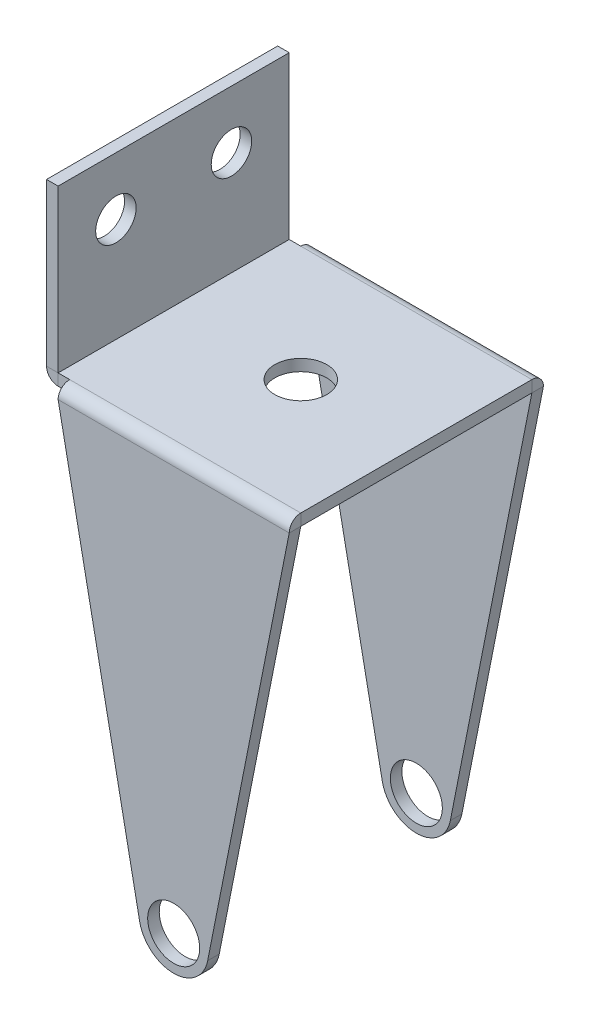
ISO-10303-21;
HEADER;
FILE_DESCRIPTION(('STEP AP214'),'2;1');
FILE_NAME('part.step','',(''),(''),'','','');
FILE_SCHEMA(('AUTOMOTIVE_DESIGN { 1 0 10303 214 1 1 1 1 }'));
ENDSEC;
DATA;
#1=APPLICATION_CONTEXT('core data for automotive mechanical design processes');
#2=APPLICATION_PROTOCOL_DEFINITION('international standard','automotive_design',2000,#1);
#3=PRODUCT_CONTEXT('',#1,'mechanical');
#4=PRODUCT('Part','Part','',(#3));
#5=PRODUCT_RELATED_PRODUCT_CATEGORY('part','',(#4));
#6=PRODUCT_DEFINITION_FORMATION('','',#4);
#7=PRODUCT_DEFINITION_CONTEXT('part definition',#1,'design');
#8=PRODUCT_DEFINITION('design','',#6,#7);
#9=PRODUCT_DEFINITION_SHAPE('','',#8);
#10=(LENGTH_UNIT() NAMED_UNIT(*) SI_UNIT(.MILLI.,.METRE.));
#11=(NAMED_UNIT(*) PLANE_ANGLE_UNIT() SI_UNIT($,.RADIAN.));
#12=(NAMED_UNIT(*) SI_UNIT($,.STERADIAN.) SOLID_ANGLE_UNIT());
#13=UNCERTAINTY_MEASURE_WITH_UNIT(LENGTH_MEASURE(1.E-05),#10,'distance_accuracy_value','');
#14=(GEOMETRIC_REPRESENTATION_CONTEXT(3) GLOBAL_UNCERTAINTY_ASSIGNED_CONTEXT((#13)) GLOBAL_UNIT_ASSIGNED_CONTEXT((#10,
#11,#12)) REPRESENTATION_CONTEXT('',''));
#15=CARTESIAN_POINT('',(0.,0.,0.));
#16=DIRECTION('',(0.,0.,1.));
#17=DIRECTION('',(1.,0.,0.));
#18=AXIS2_PLACEMENT_3D('',#15,#16,#17);
#19=CARTESIAN_POINT('',(0.,0.,45.));
#20=DIRECTION('',(0.,-1.,0.));
#21=DIRECTION('',(0.,0.,-1.));
#22=AXIS2_PLACEMENT_3D('',#19,#20,#21);
#23=PLANE('',#22);
#24=CARTESIAN_POINT('',(0.,0.,0.));
#25=DIRECTION('',(0.,1.,0.));
#26=DIRECTION('',(0.,0.,1.));
#27=AXIS2_PLACEMENT_3D('',#24,#25,#26);
#28=CIRCLE('',#27,2.25);
#29=CARTESIAN_POINT('',(0.,0.,2.25));
#30=VERTEX_POINT('',#29);
#31=EDGE_CURVE('E461',#30,#30,#28,.T.);
#32=ORIENTED_EDGE('',*,*,#31,.T.);
#33=EDGE_LOOP('',(#32));
#34=FACE_BOUND('',#33,.T.);
#35=DIRECTION('',(-1.,0.,0.));
#36=VECTOR('',#35,1.);
#37=CARTESIAN_POINT('',(-10.,0.,-10.));
#38=LINE('',#37,#36);
#39=CARTESIAN_POINT('',(-9.99996573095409,-9.99999999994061E-05,-10.0001));
#40=VERTEX_POINT('',#39);
#41=CARTESIAN_POINT('',(-11.0000000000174,0.,-10.));
#42=VERTEX_POINT('',#41);
#43=EDGE_CURVE('E460',#40,#42,#38,.T.);
#44=ORIENTED_EDGE('',*,*,#43,.F.);
#45=DIRECTION('',(1.,0.,0.));
#46=VECTOR('',#45,1.);
#47=CARTESIAN_POINT('',(0.,0.,-10.0001));
#48=LINE('',#47,#46);
#49=CARTESIAN_POINT('',(9.99996573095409,-9.99999999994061E-05,-10.0001));
#50=VERTEX_POINT('',#49);
#51=EDGE_CURVE('E79',#40,#50,#48,.T.);
#52=ORIENTED_EDGE('',*,*,#51,.T.);
#53=DIRECTION('',(0.,0.,-1.));
#54=VECTOR('',#53,1.);
#55=CARTESIAN_POINT('',(10.,0.,-10.));
#56=LINE('',#55,#54);
#57=CARTESIAN_POINT('',(9.99996573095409,-0.000100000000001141,10.0001));
#58=VERTEX_POINT('',#57);
#59=EDGE_CURVE('E477',#58,#50,#56,.T.);
#60=ORIENTED_EDGE('',*,*,#59,.F.);
#61=DIRECTION('',(-1.,0.,0.));
#62=VECTOR('',#61,1.);
#63=CARTESIAN_POINT('',(0.,0.,10.0001));
#64=LINE('',#63,#62);
#65=CARTESIAN_POINT('',(-9.99996573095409,-0.000100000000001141,10.0001));
#66=VERTEX_POINT('',#65);
#67=EDGE_CURVE('E670',#58,#66,#64,.T.);
#68=ORIENTED_EDGE('',*,*,#67,.T.);
#69=DIRECTION('',(1.,0.,0.));
#70=VECTOR('',#69,1.);
#71=CARTESIAN_POINT('',(-25.,0.,10.));
#72=LINE('',#71,#70);
#73=CARTESIAN_POINT('',(-11.,0.,10.));
#74=VERTEX_POINT('',#73);
#75=EDGE_CURVE('E464',#74,#66,#72,.T.);
#76=ORIENTED_EDGE('',*,*,#75,.F.);
#77=DIRECTION('',(0.,0.,1.));
#78=VECTOR('',#77,1.);
#79=CARTESIAN_POINT('',(-11.,0.,45.));
#80=LINE('',#79,#78);
#81=EDGE_CURVE('E449',#42,#74,#80,.T.);
#82=ORIENTED_EDGE('',*,*,#81,.F.);
#83=EDGE_LOOP('',(#44,#52,#60,#68,#76,#82));
#84=FACE_BOUND('',#83,.T.);
#85=ADVANCED_FACE('F71',(#34,#84),#23,.T.);
#86=CARTESIAN_POINT('',(-12.0001,-10.0000727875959,45.));
#87=DIRECTION('',(-1.,0.,0.));
#88=DIRECTION('',(0.,0.,-1.));
#89=AXIS2_PLACEMENT_3D('',#86,#87,#88);
#90=PLANE('',#89);
#91=CARTESIAN_POINT('',(-12.0001,9.99992721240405,-5.));
#92=DIRECTION('',(1.,0.,0.));
#93=DIRECTION('',(0.,0.,1.));
#94=AXIS2_PLACEMENT_3D('',#91,#92,#93);
#95=CIRCLE('',#94,1.75);
#96=CARTESIAN_POINT('',(-12.0001,9.99992721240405,-3.25));
#97=VERTEX_POINT('',#96);
#98=EDGE_CURVE('E482',#97,#97,#95,.T.);
#99=ORIENTED_EDGE('',*,*,#98,.T.);
#100=EDGE_LOOP('',(#99));
#101=FACE_BOUND('',#100,.T.);
#102=CARTESIAN_POINT('',(-12.0001,9.99992721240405,5.));
#103=DIRECTION('',(1.,0.,0.));
#104=DIRECTION('',(0.,0.,1.));
#105=AXIS2_PLACEMENT_3D('',#102,#103,#104);
#106=CIRCLE('',#105,1.75);
#107=CARTESIAN_POINT('',(-12.0001,9.99992721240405,6.75));
#108=VERTEX_POINT('',#107);
#109=EDGE_CURVE('E459',#108,#108,#106,.T.);
#110=ORIENTED_EDGE('',*,*,#109,.T.);
#111=EDGE_LOOP('',(#110));
#112=FACE_BOUND('',#111,.T.);
#113=DIRECTION('',(0.,1.,0.));
#114=VECTOR('',#113,1.);
#115=CARTESIAN_POINT('',(-12.0001,-7.27875959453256E-05,-10.));
#116=LINE('',#115,#114);
#117=CARTESIAN_POINT('',(-12.0001,1.0001,-10.));
#118=VERTEX_POINT('',#117);
#119=CARTESIAN_POINT('',(-12.0001,14.9999272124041,-10.));
#120=VERTEX_POINT('',#119);
#121=EDGE_CURVE('E86',#118,#120,#116,.T.);
#122=ORIENTED_EDGE('',*,*,#121,.F.);
#123=DIRECTION('',(0.,0.,1.));
#124=VECTOR('',#123,1.);
#125=CARTESIAN_POINT('',(-12.0001,1.0001,45.));
#126=LINE('',#125,#124);
#127=CARTESIAN_POINT('',(-12.0001,1.0001,10.));
#128=VERTEX_POINT('',#127);
#129=EDGE_CURVE('E507',#118,#128,#126,.T.);
#130=ORIENTED_EDGE('',*,*,#129,.T.);
#131=DIRECTION('',(0.,-1.,0.));
#132=VECTOR('',#131,1.);
#133=CARTESIAN_POINT('',(-12.0001,14.9999272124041,10.));
#134=LINE('',#133,#132);
#135=CARTESIAN_POINT('',(-12.0001,14.9999272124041,10.));
#136=VERTEX_POINT('',#135);
#137=EDGE_CURVE('E94',#136,#128,#134,.T.);
#138=ORIENTED_EDGE('',*,*,#137,.F.);
#139=DIRECTION('',(0.,0.,1.));
#140=VECTOR('',#139,1.);
#141=CARTESIAN_POINT('',(-12.0001,14.9999272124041,-10.));
#142=LINE('',#141,#140);
#143=EDGE_CURVE('E494',#120,#136,#142,.T.);
#144=ORIENTED_EDGE('',*,*,#143,.F.);
#145=EDGE_LOOP('',(#122,#130,#138,#144));
#146=FACE_BOUND('',#145,.T.);
#147=ADVANCED_FACE('F595',(#101,#112,#146),#90,.T.);
#148=CARTESIAN_POINT('',(-11.0001,-10.0000727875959,45.));
#149=DIRECTION('',(-1.,0.,0.));
#150=DIRECTION('',(0.,0.,-1.));
#151=AXIS2_PLACEMENT_3D('',#148,#149,#150);
#152=PLANE('',#151);
#153=DIRECTION('',(0.,0.,1.));
#154=VECTOR('',#153,1.);
#155=CARTESIAN_POINT('',(-11.0001,1.0001,45.));
#156=LINE('',#155,#154);
#157=CARTESIAN_POINT('',(-11.0001,1.0001,-10.));
#158=VERTEX_POINT('',#157);
#159=CARTESIAN_POINT('',(-11.0001,1.0001,10.));
#160=VERTEX_POINT('',#159);
#161=EDGE_CURVE('E501',#158,#160,#156,.T.);
#162=ORIENTED_EDGE('',*,*,#161,.F.);
#163=DIRECTION('',(0.,1.,0.));
#164=VECTOR('',#163,1.);
#165=CARTESIAN_POINT('',(-11.0001,-7.2787595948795E-05,-10.));
#166=LINE('',#165,#164);
#167=CARTESIAN_POINT('',(-11.0001,14.999927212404,-10.));
#168=VERTEX_POINT('',#167);
#169=EDGE_CURVE('E493',#158,#168,#166,.T.);
#170=ORIENTED_EDGE('',*,*,#169,.T.);
#171=DIRECTION('',(0.,0.,1.));
#172=VECTOR('',#171,1.);
#173=CARTESIAN_POINT('',(-11.0001,14.999927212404,-10.));
#174=LINE('',#173,#172);
#175=CARTESIAN_POINT('',(-11.0001,14.9999272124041,10.));
#176=VERTEX_POINT('',#175);
#177=EDGE_CURVE('E490',#168,#176,#174,.T.);
#178=ORIENTED_EDGE('',*,*,#177,.T.);
#179=DIRECTION('',(0.,-1.,0.));
#180=VECTOR('',#179,1.);
#181=CARTESIAN_POINT('',(-11.0001,14.9999272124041,10.));
#182=LINE('',#181,#180);
#183=EDGE_CURVE('E492',#176,#160,#182,.T.);
#184=ORIENTED_EDGE('',*,*,#183,.T.);
#185=EDGE_LOOP('',(#162,#170,#178,#184));
#186=FACE_BOUND('',#185,.T.);
#187=CARTESIAN_POINT('',(-11.0001,9.99992721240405,-5.));
#188=DIRECTION('',(1.,0.,0.));
#189=DIRECTION('',(0.,0.,1.));
#190=AXIS2_PLACEMENT_3D('',#187,#188,#189);
#191=CIRCLE('',#190,1.75);
#192=CARTESIAN_POINT('',(-11.0001,9.99992721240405,-3.25));
#193=VERTEX_POINT('',#192);
#194=EDGE_CURVE('E485',#193,#193,#191,.T.);
#195=ORIENTED_EDGE('',*,*,#194,.F.);
#196=EDGE_LOOP('',(#195));
#197=FACE_BOUND('',#196,.T.);
#198=CARTESIAN_POINT('',(-11.0001,9.99992721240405,5.));
#199=DIRECTION('',(1.,0.,0.));
#200=DIRECTION('',(0.,0.,1.));
#201=AXIS2_PLACEMENT_3D('',#198,#199,#200);
#202=CIRCLE('',#201,1.75);
#203=CARTESIAN_POINT('',(-11.0001,9.99992721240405,6.75));
#204=VERTEX_POINT('',#203);
#205=EDGE_CURVE('E479',#204,#204,#202,.T.);
#206=ORIENTED_EDGE('',*,*,#205,.F.);
#207=EDGE_LOOP('',(#206));
#208=FACE_BOUND('',#207,.T.);
#209=ADVANCED_FACE('F600',(#186,#197,#208),#152,.F.);
#210=CARTESIAN_POINT('',(-11.0001,-7.2787595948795E-05,-10.));
#211=DIRECTION('',(0.,0.,1.));
#212=DIRECTION('',(0.,-1.,0.));
#213=AXIS2_PLACEMENT_3D('',#210,#211,#212);
#214=PLANE('',#213);
#215=DIRECTION('',(1.,0.,0.));
#216=VECTOR('',#215,1.);
#217=CARTESIAN_POINT('',(-11.0001,1.0001,-10.));
#218=LINE('',#217,#216);
#219=EDGE_CURVE('E509',#118,#158,#218,.T.);
#220=ORIENTED_EDGE('',*,*,#219,.F.);
#221=ORIENTED_EDGE('',*,*,#121,.T.);
#222=DIRECTION('',(-1.,0.,0.));
#223=VECTOR('',#222,1.);
#224=CARTESIAN_POINT('',(-11.0001,14.999927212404,-10.));
#225=LINE('',#224,#223);
#226=EDGE_CURVE('E498',#168,#120,#225,.T.);
#227=ORIENTED_EDGE('',*,*,#226,.F.);
#228=ORIENTED_EDGE('',*,*,#169,.F.);
#229=EDGE_LOOP('',(#220,#221,#227,#228));
#230=FACE_BOUND('',#229,.T.);
#231=ADVANCED_FACE('F646',(#230),#214,.F.);
#232=CARTESIAN_POINT('',(-11.0001,14.999927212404,-10.));
#233=DIRECTION('',(0.,-1.,0.));
#234=DIRECTION('',(0.,0.,-1.));
#235=AXIS2_PLACEMENT_3D('',#232,#233,#234);
#236=PLANE('',#235);
#237=ORIENTED_EDGE('',*,*,#143,.T.);
#238=DIRECTION('',(-1.,0.,0.));
#239=VECTOR('',#238,1.);
#240=CARTESIAN_POINT('',(-11.0001,14.9999272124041,10.));
#241=LINE('',#240,#239);
#242=EDGE_CURVE('E496',#176,#136,#241,.T.);
#243=ORIENTED_EDGE('',*,*,#242,.F.);
#244=ORIENTED_EDGE('',*,*,#177,.F.);
#245=ORIENTED_EDGE('',*,*,#226,.T.);
#246=EDGE_LOOP('',(#237,#243,#244,#245));
#247=FACE_BOUND('',#246,.T.);
#248=ADVANCED_FACE('F643',(#247),#236,.F.);
#249=CARTESIAN_POINT('',(-11.0001,14.9999272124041,10.));
#250=DIRECTION('',(0.,0.,-1.));
#251=DIRECTION('',(0.,1.,0.));
#252=AXIS2_PLACEMENT_3D('',#249,#250,#251);
#253=PLANE('',#252);
#254=DIRECTION('',(-1.,0.,0.));
#255=VECTOR('',#254,1.);
#256=CARTESIAN_POINT('',(-11.0001,1.0001,10.));
#257=LINE('',#256,#255);
#258=EDGE_CURVE('E504',#160,#128,#257,.T.);
#259=ORIENTED_EDGE('',*,*,#258,.F.);
#260=ORIENTED_EDGE('',*,*,#183,.F.);
#261=ORIENTED_EDGE('',*,*,#242,.T.);
#262=ORIENTED_EDGE('',*,*,#137,.T.);
#263=EDGE_LOOP('',(#259,#260,#261,#262));
#264=FACE_BOUND('',#263,.T.);
#265=ADVANCED_FACE('F641',(#264),#253,.F.);
#266=CARTESIAN_POINT('',(-11.0001,9.99992721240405,-5.));
#267=DIRECTION('',(-1.,0.,0.));
#268=DIRECTION('',(0.,0.,-1.));
#269=AXIS2_PLACEMENT_3D('',#266,#267,#268);
#270=CYLINDRICAL_SURFACE('',#269,1.75);
#271=ORIENTED_EDGE('',*,*,#194,.T.);
#272=EDGE_LOOP('',(#271));
#273=FACE_BOUND('',#272,.T.);
#274=ORIENTED_EDGE('',*,*,#98,.F.);
#275=EDGE_LOOP('',(#274));
#276=FACE_BOUND('',#275,.T.);
#277=ADVANCED_FACE('F637',(#273,#276),#270,.F.);
#278=CARTESIAN_POINT('',(-11.0001,9.99992721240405,5.));
#279=DIRECTION('',(-1.,0.,0.));
#280=DIRECTION('',(0.,0.,-1.));
#281=AXIS2_PLACEMENT_3D('',#278,#279,#280);
#282=CYLINDRICAL_SURFACE('',#281,1.75);
#283=ORIENTED_EDGE('',*,*,#205,.T.);
#284=EDGE_LOOP('',(#283));
#285=FACE_BOUND('',#284,.T.);
#286=ORIENTED_EDGE('',*,*,#109,.F.);
#287=EDGE_LOOP('',(#286));
#288=FACE_BOUND('',#287,.T.);
#289=ADVANCED_FACE('F545',(#285,#288),#282,.F.);
#290=CARTESIAN_POINT('',(10.,1.,-10.));
#291=DIRECTION('',(-1.,0.,0.));
#292=DIRECTION('',(0.,0.,1.));
#293=AXIS2_PLACEMENT_3D('',#290,#291,#292);
#294=PLANE('',#293);
#295=ORIENTED_EDGE('',*,*,#59,.T.);
#296=CARTESIAN_POINT('',(9.99999999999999,1.,-10.));
#297=CARTESIAN_POINT('',(9.99999999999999,0.,-9.99999999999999));
#298=B_SPLINE_CURVE_WITH_KNOTS('',1,(#296,#297),.UNSPECIFIED.,.F.,.F.,(2,2),(0.,1.),.UNSPECIFIED.);
#299=CARTESIAN_POINT('',(9.99999999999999,1.,-10.));
#300=VERTEX_POINT('',#299);
#301=EDGE_CURVE('E305',#300,#50,#298,.T.);
#302=ORIENTED_EDGE('',*,*,#301,.F.);
#303=DIRECTION('',(0.,0.,-1.));
#304=VECTOR('',#303,1.);
#305=CARTESIAN_POINT('',(10.,1.,-10.));
#306=LINE('',#305,#304);
#307=CARTESIAN_POINT('',(10.,1.,10.));
#308=VERTEX_POINT('',#307);
#309=EDGE_CURVE('E468',#308,#300,#306,.T.);
#310=ORIENTED_EDGE('',*,*,#309,.F.);
#311=CARTESIAN_POINT('',(10.,0.,10.));
#312=CARTESIAN_POINT('',(10.,1.,10.));
#313=B_SPLINE_CURVE_WITH_KNOTS('',1,(#311,#312),.UNSPECIFIED.,.F.,.F.,(2,2),(0.,1.),.UNSPECIFIED.);
#314=EDGE_CURVE('E528',#308,#58,#313,.F.);
#315=ORIENTED_EDGE('',*,*,#314,.T.);
#316=EDGE_LOOP('',(#295,#302,#310,#315));
#317=FACE_BOUND('',#316,.T.);
#318=ADVANCED_FACE('F534',(#317),#294,.F.);
#319=CARTESIAN_POINT('',(0.,1.,0.));
#320=DIRECTION('',(0.,-1.,0.));
#321=DIRECTION('',(0.,0.,-1.));
#322=AXIS2_PLACEMENT_3D('',#319,#320,#321);
#323=CYLINDRICAL_SURFACE('',#322,2.25);
#324=CARTESIAN_POINT('',(0.,1.,0.));
#325=DIRECTION('',(0.,1.,0.));
#326=DIRECTION('',(0.,0.,1.));
#327=AXIS2_PLACEMENT_3D('',#324,#325,#326);
#328=CIRCLE('',#327,2.25);
#329=CARTESIAN_POINT('',(0.,1.,2.25));
#330=VERTEX_POINT('',#329);
#331=EDGE_CURVE('E474',#330,#330,#328,.T.);
#332=ORIENTED_EDGE('',*,*,#331,.T.);
#333=EDGE_LOOP('',(#332));
#334=FACE_BOUND('',#333,.T.);
#335=ORIENTED_EDGE('',*,*,#31,.F.);
#336=EDGE_LOOP('',(#335));
#337=FACE_BOUND('',#336,.T.);
#338=ADVANCED_FACE('F544',(#334,#337),#323,.F.);
#339=CARTESIAN_POINT('',(0.,1.,45.));
#340=DIRECTION('',(0.,-1.,0.));
#341=DIRECTION('',(0.,0.,-1.));
#342=AXIS2_PLACEMENT_3D('',#339,#340,#341);
#343=PLANE('',#342);
#344=DIRECTION('',(1.,0.,0.));
#345=VECTOR('',#344,1.);
#346=CARTESIAN_POINT('',(0.,1.,-9.99999999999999));
#347=LINE('',#346,#345);
#348=CARTESIAN_POINT('',(-10.,1.,-10.));
#349=VERTEX_POINT('',#348);
#350=EDGE_CURVE('E623',#349,#300,#347,.T.);
#351=ORIENTED_EDGE('',*,*,#350,.F.);
#352=DIRECTION('',(-1.,0.,0.));
#353=VECTOR('',#352,1.);
#354=CARTESIAN_POINT('',(-10.,1.,-10.));
#355=LINE('',#354,#353);
#356=CARTESIAN_POINT('',(-11.,1.,-10.));
#357=VERTEX_POINT('',#356);
#358=EDGE_CURVE('E473',#349,#357,#355,.T.);
#359=ORIENTED_EDGE('',*,*,#358,.T.);
#360=DIRECTION('',(0.,0.,1.));
#361=VECTOR('',#360,1.);
#362=CARTESIAN_POINT('',(-11.,1.,45.));
#363=LINE('',#362,#361);
#364=CARTESIAN_POINT('',(-11.,1.,10.));
#365=VERTEX_POINT('',#364);
#366=EDGE_CURVE('E469',#357,#365,#363,.T.);
#367=ORIENTED_EDGE('',*,*,#366,.T.);
#368=DIRECTION('',(1.,0.,0.));
#369=VECTOR('',#368,1.);
#370=CARTESIAN_POINT('',(-25.,1.,10.));
#371=LINE('',#370,#369);
#372=CARTESIAN_POINT('',(-10.,1.,9.99999999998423));
#373=VERTEX_POINT('',#372);
#374=EDGE_CURVE('E472',#365,#373,#371,.T.);
#375=ORIENTED_EDGE('',*,*,#374,.T.);
#376=DIRECTION('',(-1.,0.,0.));
#377=VECTOR('',#376,1.);
#378=CARTESIAN_POINT('',(0.,1.,10.));
#379=LINE('',#378,#377);
#380=EDGE_CURVE('E512',#308,#373,#379,.T.);
#381=ORIENTED_EDGE('',*,*,#380,.F.);
#382=ORIENTED_EDGE('',*,*,#309,.T.);
#383=EDGE_LOOP('',(#351,#359,#367,#375,#381,#382));
#384=FACE_BOUND('',#383,.T.);
#385=ORIENTED_EDGE('',*,*,#331,.F.);
#386=EDGE_LOOP('',(#385));
#387=FACE_BOUND('',#386,.T.);
#388=ADVANCED_FACE('F655',(#384,#387),#343,.F.);
#389=CARTESIAN_POINT('',(-25.,1.,10.));
#390=DIRECTION('',(0.,0.,-1.));
#391=DIRECTION('',(-1.,0.,0.));
#392=AXIS2_PLACEMENT_3D('',#389,#390,#391);
#393=PLANE('',#392);
#394=ORIENTED_EDGE('',*,*,#374,.F.);
#395=DIRECTION('',(0.,-1.,0.));
#396=VECTOR('',#395,1.);
#397=CARTESIAN_POINT('',(-11.,1.,10.));
#398=LINE('',#397,#396);
#399=EDGE_CURVE('E465',#365,#74,#398,.T.);
#400=ORIENTED_EDGE('',*,*,#399,.T.);
#401=ORIENTED_EDGE('',*,*,#75,.T.);
#402=CARTESIAN_POINT('',(-10.,1.,9.99999999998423));
#403=CARTESIAN_POINT('',(-10.,0.,10.));
#404=B_SPLINE_CURVE_WITH_KNOTS('',1,(#402,#403),.UNSPECIFIED.,.F.,.F.,(2,2),(0.,1.),.UNSPECIFIED.);
#405=EDGE_CURVE('E432',#373,#66,#404,.T.);
#406=ORIENTED_EDGE('',*,*,#405,.F.);
#407=EDGE_LOOP('',(#394,#400,#401,#406));
#408=FACE_BOUND('',#407,.T.);
#409=ADVANCED_FACE('F633',(#408),#393,.F.);
#410=CARTESIAN_POINT('',(-10.,1.,-10.));
#411=DIRECTION('',(0.,0.,1.));
#412=DIRECTION('',(1.,0.,0.));
#413=AXIS2_PLACEMENT_3D('',#410,#411,#412);
#414=PLANE('',#413);
#415=ORIENTED_EDGE('',*,*,#43,.T.);
#416=DIRECTION('',(0.,1.,0.));
#417=VECTOR('',#416,1.);
#418=CARTESIAN_POINT('',(-11.,1.,-10.));
#419=LINE('',#418,#417);
#420=EDGE_CURVE('E456',#42,#357,#419,.T.);
#421=ORIENTED_EDGE('',*,*,#420,.T.);
#422=ORIENTED_EDGE('',*,*,#358,.F.);
#423=CARTESIAN_POINT('',(-10.,0.,-9.99999999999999));
#424=CARTESIAN_POINT('',(-10.,1.,-10.));
#425=B_SPLINE_CURVE_WITH_KNOTS('',1,(#423,#424),.UNSPECIFIED.,.F.,.F.,(2,2),(0.,1.),.UNSPECIFIED.);
#426=EDGE_CURVE('E12',#349,#40,#425,.F.);
#427=ORIENTED_EDGE('',*,*,#426,.T.);
#428=EDGE_LOOP('',(#415,#421,#422,#427));
#429=FACE_BOUND('',#428,.T.);
#430=ADVANCED_FACE('F613',(#429),#414,.F.);
#431=CARTESIAN_POINT('',(-11.,1.0001,-10.));
#432=DIRECTION('',(0.,0.,1.));
#433=DIRECTION('',(1.,0.,0.));
#434=AXIS2_PLACEMENT_3D('',#431,#432,#433);
#435=PLANE('',#434);
#436=ORIENTED_EDGE('',*,*,#420,.F.);
#437=CARTESIAN_POINT('',(-11.,1.0001,-10.));
#438=DIRECTION('',(0.,0.,1.));
#439=DIRECTION('',(1.,0.,0.));
#440=AXIS2_PLACEMENT_3D('',#437,#438,#439);
#441=CIRCLE('',#440,1.0001);
#442=EDGE_CURVE('E452',#42,#118,#441,.F.);
#443=ORIENTED_EDGE('',*,*,#442,.T.);
#444=ORIENTED_EDGE('',*,*,#219,.T.);
#445=CARTESIAN_POINT('',(-11.,1.0001,-10.));
#446=DIRECTION('',(0.,0.,-1.));
#447=DIRECTION('',(-1.,0.,0.));
#448=AXIS2_PLACEMENT_3D('',#445,#446,#447);
#449=CIRCLE('',#448,9.99999999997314E-05);
#450=EDGE_CURVE('E437',#357,#158,#449,.T.);
#451=ORIENTED_EDGE('',*,*,#450,.F.);
#452=EDGE_LOOP('',(#436,#443,#444,#451));
#453=FACE_BOUND('',#452,.T.);
#454=ADVANCED_FACE('F546',(#453),#435,.F.);
#455=CARTESIAN_POINT('',(-11.,1.0001,10.));
#456=DIRECTION('',(0.,0.,-1.));
#457=DIRECTION('',(-1.,0.,0.));
#458=AXIS2_PLACEMENT_3D('',#455,#456,#457);
#459=PLANE('',#458);
#460=ORIENTED_EDGE('',*,*,#258,.T.);
#461=CARTESIAN_POINT('',(-11.,1.0001,10.));
#462=DIRECTION('',(0.,0.,1.));
#463=DIRECTION('',(1.,0.,0.));
#464=AXIS2_PLACEMENT_3D('',#461,#462,#463);
#465=CIRCLE('',#464,1.0001);
#466=EDGE_CURVE('E446',#128,#74,#465,.T.);
#467=ORIENTED_EDGE('',*,*,#466,.T.);
#468=ORIENTED_EDGE('',*,*,#399,.F.);
#469=CARTESIAN_POINT('',(-11.,1.0001,10.));
#470=DIRECTION('',(0.,0.,1.));
#471=DIRECTION('',(1.,0.,0.));
#472=AXIS2_PLACEMENT_3D('',#469,#470,#471);
#473=CIRCLE('',#472,9.99999999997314E-05);
#474=EDGE_CURVE('E445',#160,#365,#473,.T.);
#475=ORIENTED_EDGE('',*,*,#474,.F.);
#476=EDGE_LOOP('',(#460,#467,#468,#475));
#477=FACE_BOUND('',#476,.T.);
#478=ADVANCED_FACE('F925',(#477),#459,.F.);
#479=CARTESIAN_POINT('',(-11.,1.0001,-20.0249843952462));
#480=DIRECTION('',(0.,0.,1.));
#481=DIRECTION('',(1.,0.,0.));
#482=AXIS2_PLACEMENT_3D('',#479,#480,#481);
#483=CYLINDRICAL_SURFACE('',#482,0.0001);
#484=ORIENTED_EDGE('',*,*,#474,.T.);
#485=ORIENTED_EDGE('',*,*,#366,.F.);
#486=ORIENTED_EDGE('',*,*,#450,.T.);
#487=ORIENTED_EDGE('',*,*,#161,.T.);
#488=EDGE_LOOP('',(#484,#485,#486,#487));
#489=FACE_BOUND('',#488,.T.);
#490=ADVANCED_FACE('F914',(#489),#483,.F.);
#491=CARTESIAN_POINT('',(-11.,1.0001,-20.0249843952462));
#492=DIRECTION('',(0.,0.,1.));
#493=DIRECTION('',(1.,0.,0.));
#494=AXIS2_PLACEMENT_3D('',#491,#492,#493);
#495=CYLINDRICAL_SURFACE('',#494,1.0001);
#496=ORIENTED_EDGE('',*,*,#466,.F.);
#497=ORIENTED_EDGE('',*,*,#129,.F.);
#498=ORIENTED_EDGE('',*,*,#442,.F.);
#499=ORIENTED_EDGE('',*,*,#81,.T.);
#500=EDGE_LOOP('',(#496,#497,#498,#499));
#501=FACE_BOUND('',#500,.T.);
#502=ADVANCED_FACE('F374',(#501),#495,.T.);
#503=CARTESIAN_POINT('',(9.99996573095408,-0.000100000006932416,11.0001));
#504=CARTESIAN_POINT('',(9.9999685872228,0.13083638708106,11.0001000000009));
#505=CARTESIAN_POINT('',(9.99997144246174,0.261674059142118,10.9740700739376));
#506=CARTESIAN_POINT('',(9.99997715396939,0.503569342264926,10.8738737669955));
#507=CARTESIAN_POINT('',(9.99998000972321,0.614508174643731,10.799746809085));
#508=CARTESIAN_POINT('',(9.99998572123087,0.799646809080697,10.6146081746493));
#509=CARTESIAN_POINT('',(9.9999885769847,0.873773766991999,10.503669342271));
#510=CARTESIAN_POINT('',(9.99999428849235,0.973970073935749,10.2617740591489));
#511=CARTESIAN_POINT('',(9.99999714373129,1.,10.130936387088));
#512=CARTESIAN_POINT('',(10.,1.,10.));
#513=CARTESIAN_POINT('',(9.99996573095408,-0.00010000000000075,10.0001));
#514=CARTESIAN_POINT('',(9.9999685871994,-8.69077777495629E-05,10.0001));
#515=CARTESIAN_POINT('',(9.99997144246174,-7.38252115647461E-05,10.0000973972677));
#516=CARTESIAN_POINT('',(9.99997715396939,-4.96381019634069E-05,10.0000873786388));
#517=CARTESIAN_POINT('',(9.99998000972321,-3.85453280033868E-05,10.0000799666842));
#518=CARTESIAN_POINT('',(9.99998572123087,-2.00333157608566E-05,10.000061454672));
#519=CARTESIAN_POINT('',(9.9999885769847,-1.26213611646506E-05,10.000050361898));
#520=CARTESIAN_POINT('',(9.99999428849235,-2.60273233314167E-06,10.0000261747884));
#521=CARTESIAN_POINT('',(9.99999714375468,0.,10.0000130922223));
#522=CARTESIAN_POINT('',(10.,0.,10.));
#523=B_SPLINE_SURFACE_WITH_KNOTS('',1,3,((#503,#504,#505,#506,#507,#508,#509,#510,#511,#512),
(#513,#514,#515,#516,#517,#518,#519,#520,#521,#522)),.UNSPECIFIED.,.F.,.F.,.F.,(2,2),(4,2,2,2,
4),(0.,1.),(0.,0.25,0.5,0.75,1.),.UNSPECIFIED.);
#524=CARTESIAN_POINT('',(9.99996573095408,-0.000100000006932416,11.0001));
#525=CARTESIAN_POINT('',(9.99996573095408,-0.00010000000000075,10.0001));
#526=B_SPLINE_CURVE_WITH_KNOTS('',1,(#524,#525),.UNSPECIFIED.,.F.,.F.,(2,2),(0.,1.),.UNSPECIFIED.);
#527=CARTESIAN_POINT('',(9.99996573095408,-0.000100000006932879,11.0001));
#528=VERTEX_POINT('',#527);
#529=EDGE_CURVE('E319',#58,#528,#526,.F.);
#530=CARTESIAN_POINT('',(10.,1.,10.));
#531=CARTESIAN_POINT('',(9.99999714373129,1.,10.130936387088));
#532=CARTESIAN_POINT('',(9.99999428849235,0.973970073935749,10.2617740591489));
#533=CARTESIAN_POINT('',(9.9999885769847,0.873773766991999,10.503669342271));
#534=CARTESIAN_POINT('',(9.99998572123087,0.799646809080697,10.6146081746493));
#535=CARTESIAN_POINT('',(9.99998000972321,0.614508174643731,10.799746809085));
#536=CARTESIAN_POINT('',(9.99997715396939,0.503569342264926,10.8738737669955));
#537=CARTESIAN_POINT('',(9.99997144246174,0.261674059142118,10.9740700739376));
#538=CARTESIAN_POINT('',(9.9999685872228,0.13083638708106,11.0001000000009));
#539=CARTESIAN_POINT('',(9.99996573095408,-0.000100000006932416,11.0001));
#540=B_SPLINE_CURVE_WITH_KNOTS('',3,(#530,#531,#532,#533,#534,#535,#536,#537,#538,#539),
.UNSPECIFIED.,.F.,.F.,(4,2,2,2,4),(0.,0.25,0.5,0.75,1.),.UNSPECIFIED.);
#541=EDGE_CURVE('E318',#528,#308,#540,.F.);
#542=ORIENTED_EDGE('',*,*,#529,.F.);
#543=ORIENTED_EDGE('',*,*,#314,.F.);
#544=ORIENTED_EDGE('',*,*,#541,.F.);
#545=EDGE_LOOP('',(#542,#543,#544));
#546=FACE_BOUND('',#545,.T.);
#547=ADVANCED_FACE('F365',(#546),#523,.T.);
#548=CARTESIAN_POINT('',(-10.,1.,9.99999999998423));
#549=CARTESIAN_POINT('',(-9.99999714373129,1.00000000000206,10.1309363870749));
#550=CARTESIAN_POINT('',(-9.99999428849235,0.973970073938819,10.2617740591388));
#551=CARTESIAN_POINT('',(-9.9999885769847,0.873773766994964,10.5036693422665));
#552=CARTESIAN_POINT('',(-9.99998572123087,0.799646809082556,10.6146081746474));
#553=CARTESIAN_POINT('',(-9.99998000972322,0.614508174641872,10.7997468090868));
#554=CARTESIAN_POINT('',(-9.9999771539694,0.503569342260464,10.8738737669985));
#555=CARTESIAN_POINT('',(-9.99997144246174,0.261674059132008,10.9740700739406));
#556=CARTESIAN_POINT('',(-9.9999685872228,0.130836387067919,11.000100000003));
#557=CARTESIAN_POINT('',(-9.99996573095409,-0.000100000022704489,11.0001));
#558=CARTESIAN_POINT('',(-10.,0.,10.));
#559=CARTESIAN_POINT('',(-9.99999714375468,0.,10.0000130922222));
#560=CARTESIAN_POINT('',(-9.99999428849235,-2.60273233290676E-06,10.0000261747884));
#561=CARTESIAN_POINT('',(-9.9999885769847,-1.26213611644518E-05,10.000050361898));
#562=CARTESIAN_POINT('',(-9.99998572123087,-2.00333157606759E-05,10.000061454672));
#563=CARTESIAN_POINT('',(-9.99998000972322,-3.85453280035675E-05,10.0000799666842));
#564=CARTESIAN_POINT('',(-9.9999771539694,-4.96381019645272E-05,10.0000873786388));
#565=CARTESIAN_POINT('',(-9.99997144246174,-7.38252115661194E-05,10.0000973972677));
#566=CARTESIAN_POINT('',(-9.99996858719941,-8.6907777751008E-05,10.0001));
#567=CARTESIAN_POINT('',(-9.99996573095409,-0.000100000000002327,10.0001));
#568=B_SPLINE_SURFACE_WITH_KNOTS('',1,3,((#548,#549,#550,#551,#552,#553,#554,#555,#556,#557),
(#558,#559,#560,#561,#562,#563,#564,#565,#566,#567)),.UNSPECIFIED.,.F.,.F.,.F.,(2,2),(4,2,2,2,
4),(0.,1.),(0.,0.25,0.5,0.75,1.),.UNSPECIFIED.);
#569=CARTESIAN_POINT('',(-9.99996573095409,-0.000100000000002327,10.0001));
#570=CARTESIAN_POINT('',(-9.99996573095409,-0.000100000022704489,11.0001));
#571=B_SPLINE_CURVE_WITH_KNOTS('',1,(#569,#570),.UNSPECIFIED.,.F.,.F.,(2,2),(0.,1.),.UNSPECIFIED.);
#572=CARTESIAN_POINT('',(-9.99996573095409,-0.000100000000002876,11.0001));
#573=VERTEX_POINT('',#572);
#574=EDGE_CURVE('E327',#573,#66,#571,.F.);
#575=CARTESIAN_POINT('',(-9.99996573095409,-0.000100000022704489,11.0001));
#576=CARTESIAN_POINT('',(-9.9999685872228,0.130836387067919,11.000100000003));
#577=CARTESIAN_POINT('',(-9.99997144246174,0.261674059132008,10.9740700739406));
#578=CARTESIAN_POINT('',(-9.9999771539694,0.503569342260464,10.8738737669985));
#579=CARTESIAN_POINT('',(-9.99998000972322,0.614508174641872,10.7997468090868));
#580=CARTESIAN_POINT('',(-9.99998572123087,0.799646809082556,10.6146081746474));
#581=CARTESIAN_POINT('',(-9.9999885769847,0.873773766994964,10.5036693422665));
#582=CARTESIAN_POINT('',(-9.99999428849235,0.973970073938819,10.2617740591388));
#583=CARTESIAN_POINT('',(-9.99999714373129,1.00000000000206,10.1309363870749));
#584=CARTESIAN_POINT('',(-10.,1.,9.99999999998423));
#585=B_SPLINE_CURVE_WITH_KNOTS('',3,(#575,#576,#577,#578,#579,#580,#581,#582,#583,#584),
.UNSPECIFIED.,.F.,.F.,(4,2,2,2,4),(0.,0.25,0.5,0.75,1.),.UNSPECIFIED.);
#586=EDGE_CURVE('E455',#373,#573,#585,.F.);
#587=ORIENTED_EDGE('',*,*,#405,.T.);
#588=ORIENTED_EDGE('',*,*,#574,.F.);
#589=ORIENTED_EDGE('',*,*,#586,.F.);
#590=EDGE_LOOP('',(#587,#588,#589));
#591=FACE_BOUND('',#590,.T.);
#592=ADVANCED_FACE('F363',(#591),#568,.T.);
#593=CARTESIAN_POINT('',(-20.0249843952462,-0.000100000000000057,10.));
#594=DIRECTION('',(1.,0.,0.));
#595=DIRECTION('',(0.,0.,-1.));
#596=AXIS2_PLACEMENT_3D('',#593,#594,#595);
#597=CYLINDRICAL_SURFACE('',#596,1.0001);
#598=ORIENTED_EDGE('',*,*,#380,.T.);
#599=ORIENTED_EDGE('',*,*,#586,.T.);
#600=DIRECTION('',(-1.,0.,0.));
#601=VECTOR('',#600,1.);
#602=CARTESIAN_POINT('',(0.,-0.00010000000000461,11.0001));
#603=LINE('',#602,#601);
#604=EDGE_CURVE('E728',#528,#573,#603,.T.);
#605=ORIENTED_EDGE('',*,*,#604,.F.);
#606=ORIENTED_EDGE('',*,*,#541,.T.);
#607=EDGE_LOOP('',(#598,#599,#605,#606));
#608=FACE_BOUND('',#607,.T.);
#609=ADVANCED_FACE('F352',(#608),#597,.T.);
#610=CARTESIAN_POINT('',(0.,-34.9999272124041,11.0000999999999));
#611=DIRECTION('',(0.,0.,-1.));
#612=DIRECTION('',(0.,1.,0.));
#613=AXIS2_PLACEMENT_3D('',#610,#611,#612);
#614=CYLINDRICAL_SURFACE('',#613,3.);
#615=CARTESIAN_POINT('',(0.,-34.9999272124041,10.0000999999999));
#616=DIRECTION('',(0.,0.,1.));
#617=DIRECTION('',(0.,1.,0.));
#618=AXIS2_PLACEMENT_3D('',#615,#616,#617);
#619=CIRCLE('',#618,3.);
#620=CARTESIAN_POINT('',(-2.94268301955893,-35.583550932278,10.0000999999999));
#621=VERTEX_POINT('',#620);
#622=CARTESIAN_POINT('',(2.94268301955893,-35.583550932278,10.0000999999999));
#623=VERTEX_POINT('',#622);
#624=EDGE_CURVE('E336',#621,#623,#619,.T.);
#625=ORIENTED_EDGE('',*,*,#624,.T.);
#626=DIRECTION('',(0.,0.,-1.));
#627=VECTOR('',#626,1.);
#628=CARTESIAN_POINT('',(2.94268301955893,-35.583550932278,11.0000999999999));
#629=LINE('',#628,#627);
#630=CARTESIAN_POINT('',(2.94268301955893,-35.583550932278,11.0000999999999));
#631=VERTEX_POINT('',#630);
#632=EDGE_CURVE('E310',#631,#623,#629,.T.);
#633=ORIENTED_EDGE('',*,*,#632,.F.);
#634=CARTESIAN_POINT('',(0.,-34.9999272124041,11.0000999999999));
#635=DIRECTION('',(0.,0.,1.));
#636=DIRECTION('',(0.,1.,0.));
#637=AXIS2_PLACEMENT_3D('',#634,#635,#636);
#638=CIRCLE('',#637,3.);
#639=CARTESIAN_POINT('',(-2.94268301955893,-35.583550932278,11.0000999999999));
#640=VERTEX_POINT('',#639);
#641=EDGE_CURVE('E325',#640,#631,#638,.T.);
#642=ORIENTED_EDGE('',*,*,#641,.F.);
#643=DIRECTION('',(0.,0.,-1.));
#644=VECTOR('',#643,1.);
#645=CARTESIAN_POINT('',(-2.94268301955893,-35.583550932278,11.0000999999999));
#646=LINE('',#645,#644);
#647=EDGE_CURVE('E333',#640,#621,#646,.T.);
#648=ORIENTED_EDGE('',*,*,#647,.T.);
#649=EDGE_LOOP('',(#625,#633,#642,#648));
#650=FACE_BOUND('',#649,.T.);
#651=ADVANCED_FACE('F362',(#650),#614,.T.);
#652=CARTESIAN_POINT('',(0.,-34.9999272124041,11.0000999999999));
#653=DIRECTION('',(0.,0.,-1.));
#654=DIRECTION('',(0.,1.,0.));
#655=AXIS2_PLACEMENT_3D('',#652,#653,#654);
#656=CYLINDRICAL_SURFACE('',#655,2.25);
#657=CARTESIAN_POINT('',(0.,-34.9999272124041,11.0000999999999));
#658=DIRECTION('',(0.,0.,1.));
#659=DIRECTION('',(0.,1.,0.));
#660=AXIS2_PLACEMENT_3D('',#657,#658,#659);
#661=CIRCLE('',#660,2.25);
#662=CARTESIAN_POINT('',(0.,-32.7499272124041,11.0000999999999));
#663=VERTEX_POINT('',#662);
#664=EDGE_CURVE('E329',#663,#663,#661,.T.);
#665=ORIENTED_EDGE('',*,*,#664,.T.);
#666=EDGE_LOOP('',(#665));
#667=FACE_BOUND('',#666,.T.);
#668=CARTESIAN_POINT('',(0.,-34.9999272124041,10.0000999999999));
#669=DIRECTION('',(0.,0.,1.));
#670=DIRECTION('',(0.,1.,0.));
#671=AXIS2_PLACEMENT_3D('',#668,#669,#670);
#672=CIRCLE('',#671,2.25);
#673=CARTESIAN_POINT('',(0.,-32.7499272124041,10.0000999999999));
#674=VERTEX_POINT('',#673);
#675=EDGE_CURVE('E320',#674,#674,#672,.T.);
#676=ORIENTED_EDGE('',*,*,#675,.F.);
#677=EDGE_LOOP('',(#676));
#678=FACE_BOUND('',#677,.T.);
#679=ADVANCED_FACE('F716',(#667,#678),#656,.F.);
#680=CARTESIAN_POINT('',(0.,-34.9999272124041,11.0000999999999));
#681=DIRECTION('',(0.,0.,-1.));
#682=DIRECTION('',(0.,1.,0.));
#683=AXIS2_PLACEMENT_3D('',#680,#681,#682);
#684=PLANE('',#683);
#685=ORIENTED_EDGE('',*,*,#664,.F.);
#686=EDGE_LOOP('',(#685));
#687=FACE_BOUND('',#686,.T.);
#688=DIRECTION('',(0.194541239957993,0.980894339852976,0.));
#689=VECTOR('',#688,1.);
#690=CARTESIAN_POINT('',(10.,7.27875959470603E-05,11.0001));
#691=LINE('',#690,#689);
#692=EDGE_CURVE('E332',#631,#528,#691,.T.);
#693=ORIENTED_EDGE('',*,*,#692,.T.);
#694=ORIENTED_EDGE('',*,*,#604,.T.);
#695=DIRECTION('',(0.194541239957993,-0.980894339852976,0.));
#696=VECTOR('',#695,1.);
#697=CARTESIAN_POINT('',(-10.,7.2787595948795E-05,11.0001));
#698=LINE('',#697,#696);
#699=EDGE_CURVE('E328',#573,#640,#698,.T.);
#700=ORIENTED_EDGE('',*,*,#699,.T.);
#701=ORIENTED_EDGE('',*,*,#641,.T.);
#702=EDGE_LOOP('',(#693,#694,#700,#701));
#703=FACE_BOUND('',#702,.T.);
#704=ADVANCED_FACE('F704',(#687,#703),#684,.F.);
#705=CARTESIAN_POINT('',(-10.,7.2787595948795E-05,11.0001));
#706=DIRECTION('',(0.980894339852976,0.194541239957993,0.));
#707=DIRECTION('',(-0.194541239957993,0.980894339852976,0.));
#708=AXIS2_PLACEMENT_3D('',#705,#706,#707);
#709=PLANE('',#708);
#710=ORIENTED_EDGE('',*,*,#699,.F.);
#711=ORIENTED_EDGE('',*,*,#574,.T.);
#712=DIRECTION('',(0.194541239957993,-0.980894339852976,0.));
#713=VECTOR('',#712,1.);
#714=CARTESIAN_POINT('',(-10.,7.27875959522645E-05,10.0001));
#715=LINE('',#714,#713);
#716=EDGE_CURVE('E324',#66,#621,#715,.T.);
#717=ORIENTED_EDGE('',*,*,#716,.T.);
#718=ORIENTED_EDGE('',*,*,#647,.F.);
#719=EDGE_LOOP('',(#710,#711,#717,#718));
#720=FACE_BOUND('',#719,.T.);
#721=ADVANCED_FACE('F694',(#720),#709,.F.);
#722=CARTESIAN_POINT('',(0.,-34.9999272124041,10.0000999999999));
#723=DIRECTION('',(0.,0.,-1.));
#724=DIRECTION('',(0.,1.,0.));
#725=AXIS2_PLACEMENT_3D('',#722,#723,#724);
#726=PLANE('',#725);
#727=ORIENTED_EDGE('',*,*,#67,.F.);
#728=DIRECTION('',(0.194541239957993,0.980894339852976,0.));
#729=VECTOR('',#728,1.);
#730=CARTESIAN_POINT('',(10.,7.27875959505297E-05,10.0001));
#731=LINE('',#730,#729);
#732=EDGE_CURVE('E323',#623,#58,#731,.T.);
#733=ORIENTED_EDGE('',*,*,#732,.F.);
#734=ORIENTED_EDGE('',*,*,#624,.F.);
#735=ORIENTED_EDGE('',*,*,#716,.F.);
#736=EDGE_LOOP('',(#727,#733,#734,#735));
#737=FACE_BOUND('',#736,.T.);
#738=ORIENTED_EDGE('',*,*,#675,.T.);
#739=EDGE_LOOP('',(#738));
#740=FACE_BOUND('',#739,.T.);
#741=ADVANCED_FACE('F703',(#737,#740),#726,.T.);
#742=CARTESIAN_POINT('',(10.,7.27875959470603E-05,11.0001));
#743=DIRECTION('',(-0.980894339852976,0.194541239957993,0.));
#744=DIRECTION('',(-0.194541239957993,-0.980894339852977,0.));
#745=AXIS2_PLACEMENT_3D('',#742,#743,#744);
#746=PLANE('',#745);
#747=ORIENTED_EDGE('',*,*,#732,.T.);
#748=ORIENTED_EDGE('',*,*,#529,.T.);
#749=ORIENTED_EDGE('',*,*,#692,.F.);
#750=ORIENTED_EDGE('',*,*,#632,.T.);
#751=EDGE_LOOP('',(#747,#748,#749,#750));
#752=FACE_BOUND('',#751,.T.);
#753=ADVANCED_FACE('F250',(#752),#746,.F.);
#754=CARTESIAN_POINT('',(-9.99996573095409,-0.000100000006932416,-11.0001));
#755=CARTESIAN_POINT('',(-9.9999685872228,0.13083638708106,-11.0001000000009));
#756=CARTESIAN_POINT('',(-9.99997144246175,0.261674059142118,-10.9740700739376));
#757=CARTESIAN_POINT('',(-9.9999771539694,0.503569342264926,-10.8738737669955));
#758=CARTESIAN_POINT('',(-9.99998000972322,0.614508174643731,-10.799746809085));
#759=CARTESIAN_POINT('',(-9.99998572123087,0.799646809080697,-10.6146081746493));
#760=CARTESIAN_POINT('',(-9.9999885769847,0.873773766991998,-10.503669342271));
#761=CARTESIAN_POINT('',(-9.99999428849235,0.973970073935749,-10.2617740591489));
#762=CARTESIAN_POINT('',(-9.99999714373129,1.,-10.130936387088));
#763=CARTESIAN_POINT('',(-10.,1.,-10.));
#764=CARTESIAN_POINT('',(-9.99996573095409,-0.00010000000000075,-10.0001));
#765=CARTESIAN_POINT('',(-9.99996858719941,-8.69077777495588E-05,-10.0001));
#766=CARTESIAN_POINT('',(-9.99997144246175,-7.38252115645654E-05,-10.0000973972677));
#767=CARTESIAN_POINT('',(-9.9999771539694,-4.96381019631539E-05,-10.0000873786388));
#768=CARTESIAN_POINT('',(-9.99998000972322,-3.85453280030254E-05,-10.0000799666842));
#769=CARTESIAN_POINT('',(-9.99998572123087,-2.00333157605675E-05,-10.000061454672));
#770=CARTESIAN_POINT('',(-9.9999885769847,-1.26213611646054E-05,-10.000050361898));
#771=CARTESIAN_POINT('',(-9.99999428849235,-2.60273233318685E-06,-10.0000261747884));
#772=CARTESIAN_POINT('',(-9.99999714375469,0.,-10.0000130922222));
#773=CARTESIAN_POINT('',(-10.,0.,-9.99999999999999));
#774=B_SPLINE_SURFACE_WITH_KNOTS('',1,3,((#754,#755,#756,#757,#758,#759,#760,#761,#762,#763),
(#764,#765,#766,#767,#768,#769,#770,#771,#772,#773)),.UNSPECIFIED.,.F.,.F.,.F.,(2,2),(4,2,2,2,
4),(0.,1.),(0.,0.25,0.5,0.75,1.),.UNSPECIFIED.);
#775=CARTESIAN_POINT('',(-9.99996573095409,-0.000100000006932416,-11.0001));
#776=CARTESIAN_POINT('',(-9.99996573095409,-0.00010000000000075,-10.0001));
#777=B_SPLINE_CURVE_WITH_KNOTS('',1,(#775,#776),.UNSPECIFIED.,.F.,.F.,(2,2),(0.,1.),.UNSPECIFIED.);
#778=CARTESIAN_POINT('',(-9.99996573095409,-0.000100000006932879,-11.0001));
#779=VERTEX_POINT('',#778);
#780=EDGE_CURVE('E216',#40,#779,#777,.F.);
#781=CARTESIAN_POINT('',(-10.,1.,-10.));
#782=CARTESIAN_POINT('',(-9.99999714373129,1.,-10.130936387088));
#783=CARTESIAN_POINT('',(-9.99999428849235,0.973970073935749,-10.2617740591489));
#784=CARTESIAN_POINT('',(-9.9999885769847,0.873773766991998,-10.503669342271));
#785=CARTESIAN_POINT('',(-9.99998572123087,0.799646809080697,-10.6146081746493));
#786=CARTESIAN_POINT('',(-9.99998000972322,0.614508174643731,-10.799746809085));
#787=CARTESIAN_POINT('',(-9.9999771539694,0.503569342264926,-10.8738737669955));
#788=CARTESIAN_POINT('',(-9.99997144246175,0.261674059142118,-10.9740700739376));
#789=CARTESIAN_POINT('',(-9.9999685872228,0.13083638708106,-11.0001000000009));
#790=CARTESIAN_POINT('',(-9.99996573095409,-0.000100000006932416,-11.0001));
#791=B_SPLINE_CURVE_WITH_KNOTS('',3,(#781,#782,#783,#784,#785,#786,#787,#788,#789,#790),
.UNSPECIFIED.,.F.,.F.,(4,2,2,2,4),(0.,0.25,0.5,0.75,1.),.UNSPECIFIED.);
#792=EDGE_CURVE('E742',#779,#349,#791,.F.);
#793=ORIENTED_EDGE('',*,*,#780,.F.);
#794=ORIENTED_EDGE('',*,*,#426,.F.);
#795=ORIENTED_EDGE('',*,*,#792,.F.);
#796=EDGE_LOOP('',(#793,#794,#795));
#797=FACE_BOUND('',#796,.T.);
#798=ADVANCED_FACE('F240',(#797),#774,.T.);
#799=CARTESIAN_POINT('',(9.99999999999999,1.,-10.));
#800=CARTESIAN_POINT('',(9.99999714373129,1.,-10.130936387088));
#801=CARTESIAN_POINT('',(9.99999428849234,0.97397007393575,-10.2617740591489));
#802=CARTESIAN_POINT('',(9.99998857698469,0.873773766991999,-10.503669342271));
#803=CARTESIAN_POINT('',(9.99998572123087,0.799646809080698,-10.6146081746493));
#804=CARTESIAN_POINT('',(9.99998000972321,0.614508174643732,-10.799746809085));
#805=CARTESIAN_POINT('',(9.99997715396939,0.503569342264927,-10.8738737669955));
#806=CARTESIAN_POINT('',(9.99997144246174,0.261674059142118,-10.9740700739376));
#807=CARTESIAN_POINT('',(9.9999685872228,0.13083638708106,-11.0001000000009));
#808=CARTESIAN_POINT('',(9.99996573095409,-0.000100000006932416,-11.0001));
#809=CARTESIAN_POINT('',(9.99999999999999,0.,-9.99999999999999));
#810=CARTESIAN_POINT('',(9.99999714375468,0.,-10.0000130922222));
#811=CARTESIAN_POINT('',(9.99999428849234,-2.60273233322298E-06,-10.0000261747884));
#812=CARTESIAN_POINT('',(9.99998857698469,-1.26213611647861E-05,-10.000050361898));
#813=CARTESIAN_POINT('',(9.99998572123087,-2.00333157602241E-05,-10.000061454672));
#814=CARTESIAN_POINT('',(9.99998000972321,-3.85453280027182E-05,-10.0000799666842));
#815=CARTESIAN_POINT('',(9.99997715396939,-4.96381019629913E-05,-10.0000873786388));
#816=CARTESIAN_POINT('',(9.99997144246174,-7.38252115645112E-05,-10.0000973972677));
#817=CARTESIAN_POINT('',(9.9999685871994,-8.69077777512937E-05,-10.0001));
#818=CARTESIAN_POINT('',(9.99996573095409,-0.00010000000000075,-10.0001));
#819=B_SPLINE_SURFACE_WITH_KNOTS('',1,3,((#799,#800,#801,#802,#803,#804,#805,#806,#807,#808),
(#809,#810,#811,#812,#813,#814,#815,#816,#817,#818)),.UNSPECIFIED.,.F.,.F.,.F.,(2,2),(4,2,2,2,
4),(0.,1.),(0.,0.25,0.5,0.75,1.),.UNSPECIFIED.);
#820=CARTESIAN_POINT('',(9.99996573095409,-0.00010000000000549,-10.00005));
#821=CARTESIAN_POINT('',(9.99996573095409,-0.000100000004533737,-10.04171875));
#822=CARTESIAN_POINT('',(9.99996573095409,-0.000100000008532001,-10.0833875));
#823=CARTESIAN_POINT('',(9.99996573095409,-0.000100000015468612,-10.166725));
#824=CARTESIAN_POINT('',(9.99996573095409,-0.000100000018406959,-10.20839375));
#825=CARTESIAN_POINT('',(9.99996573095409,-0.000100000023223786,-10.29173125));
#826=CARTESIAN_POINT('',(9.99996573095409,-0.000100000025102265,-10.3334));
#827=CARTESIAN_POINT('',(9.99996573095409,-0.000100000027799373,-10.4167375));
#828=CARTESIAN_POINT('',(9.99996573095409,-0.000100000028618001,-10.45840625));
#829=CARTESIAN_POINT('',(9.99996573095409,-0.000100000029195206,-10.54174375));
#830=CARTESIAN_POINT('',(9.99996573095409,-0.000100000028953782,-10.5834125));
#831=CARTESIAN_POINT('',(9.99996573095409,-0.000100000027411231,-10.66675));
#832=CARTESIAN_POINT('',(9.99996573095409,-0.000100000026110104,-10.70841875));
#833=CARTESIAN_POINT('',(9.99996573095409,-0.000100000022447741,-10.79175625));
#834=CARTESIAN_POINT('',(9.99996573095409,-0.000100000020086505,-10.833425));
#835=CARTESIAN_POINT('',(9.99996573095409,-0.000100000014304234,-10.9167625));
#836=CARTESIAN_POINT('',(9.99996573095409,-0.000100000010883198,-10.95843125));
#837=CARTESIAN_POINT('',(9.99996573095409,-0.000100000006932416,-11.0001));
#838=B_SPLINE_CURVE_WITH_KNOTS('',3,(#820,#821,#822,#823,#824,#825,#826,#827,#828,#829,#830,
#831,#832,#833,#834,#835,#836,#837),.UNSPECIFIED.,.F.,.F.,(4,2,2,2,2,2,2,2,4),(0.,0.12500625,
0.250012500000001,0.375018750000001,0.500025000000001,0.62503125,0.7500375,0.87504375,1.00005),.UNSPECIFIED.);
#839=CARTESIAN_POINT('',(9.99996573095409,-0.000100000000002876,-11.0001));
#840=VERTEX_POINT('',#839);
#841=EDGE_CURVE('E192',#840,#50,#838,.F.);
#842=CARTESIAN_POINT('',(9.99996573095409,-0.000100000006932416,-11.0001));
#843=CARTESIAN_POINT('',(9.9999685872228,0.13083638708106,-11.0001000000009));
#844=CARTESIAN_POINT('',(9.99997144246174,0.261674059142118,-10.9740700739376));
#845=CARTESIAN_POINT('',(9.99997715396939,0.503569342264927,-10.8738737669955));
#846=CARTESIAN_POINT('',(9.99998000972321,0.614508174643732,-10.799746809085));
#847=CARTESIAN_POINT('',(9.99998572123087,0.799646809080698,-10.6146081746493));
#848=CARTESIAN_POINT('',(9.99998857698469,0.873773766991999,-10.503669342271));
#849=CARTESIAN_POINT('',(9.99999428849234,0.97397007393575,-10.2617740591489));
#850=CARTESIAN_POINT('',(9.99999714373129,1.,-10.130936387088));
#851=CARTESIAN_POINT('',(9.99999999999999,1.,-10.));
#852=B_SPLINE_CURVE_WITH_KNOTS('',3,(#842,#843,#844,#845,#846,#847,#848,#849,#850,#851),
.UNSPECIFIED.,.F.,.F.,(4,2,2,2,4),(0.,0.25,0.5,0.75,1.),.UNSPECIFIED.);
#853=EDGE_CURVE('E338',#300,#840,#852,.F.);
#854=ORIENTED_EDGE('',*,*,#301,.T.);
#855=ORIENTED_EDGE('',*,*,#841,.F.);
#856=ORIENTED_EDGE('',*,*,#853,.F.);
#857=EDGE_LOOP('',(#854,#855,#856));
#858=FACE_BOUND('',#857,.T.);
#859=ADVANCED_FACE('F238',(#858),#819,.T.);
#860=CARTESIAN_POINT('',(20.0249843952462,-0.000100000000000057,-9.99999999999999));
#861=DIRECTION('',(-1.,0.,0.));
#862=DIRECTION('',(0.,0.,1.));
#863=AXIS2_PLACEMENT_3D('',#860,#861,#862);
#864=CYLINDRICAL_SURFACE('',#863,1.0001);
#865=ORIENTED_EDGE('',*,*,#350,.T.);
#866=ORIENTED_EDGE('',*,*,#853,.T.);
#867=DIRECTION('',(1.,0.,0.));
#868=VECTOR('',#867,1.);
#869=CARTESIAN_POINT('',(0.,-9.99999999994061E-05,-11.0001));
#870=LINE('',#869,#868);
#871=EDGE_CURVE('E564',#779,#840,#870,.T.);
#872=ORIENTED_EDGE('',*,*,#871,.F.);
#873=ORIENTED_EDGE('',*,*,#792,.T.);
#874=EDGE_LOOP('',(#865,#866,#872,#873));
#875=FACE_BOUND('',#874,.T.);
#876=ADVANCED_FACE('F228',(#875),#864,.T.);
#877=CARTESIAN_POINT('',(0.,-34.9999272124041,-11.0000999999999));
#878=DIRECTION('',(0.,0.,1.));
#879=DIRECTION('',(0.,-1.,0.));
#880=AXIS2_PLACEMENT_3D('',#877,#878,#879);
#881=CYLINDRICAL_SURFACE('',#880,3.);
#882=CARTESIAN_POINT('',(0.,-34.9999272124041,-10.0000999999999));
#883=DIRECTION('',(0.,0.,-1.));
#884=DIRECTION('',(0.,1.,0.));
#885=AXIS2_PLACEMENT_3D('',#882,#883,#884);
#886=CIRCLE('',#885,3.);
#887=CARTESIAN_POINT('',(2.94268301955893,-35.583550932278,-10.0000999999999));
#888=VERTEX_POINT('',#887);
#889=CARTESIAN_POINT('',(-2.94268301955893,-35.583550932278,-10.0000999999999));
#890=VERTEX_POINT('',#889);
#891=EDGE_CURVE('E203',#888,#890,#886,.T.);
#892=ORIENTED_EDGE('',*,*,#891,.T.);
#893=DIRECTION('',(0.,0.,1.));
#894=VECTOR('',#893,1.);
#895=CARTESIAN_POINT('',(-2.94268301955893,-35.583550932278,-11.0000999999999));
#896=LINE('',#895,#894);
#897=CARTESIAN_POINT('',(-2.94268301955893,-35.583550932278,-11.0000999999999));
#898=VERTEX_POINT('',#897);
#899=EDGE_CURVE('E744',#898,#890,#896,.T.);
#900=ORIENTED_EDGE('',*,*,#899,.F.);
#901=CARTESIAN_POINT('',(0.,-34.9999272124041,-11.0000999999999));
#902=DIRECTION('',(0.,0.,-1.));
#903=DIRECTION('',(0.,1.,0.));
#904=AXIS2_PLACEMENT_3D('',#901,#902,#903);
#905=CIRCLE('',#904,3.);
#906=CARTESIAN_POINT('',(2.94268301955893,-35.583550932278,-11.0000999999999));
#907=VERTEX_POINT('',#906);
#908=EDGE_CURVE('E205',#907,#898,#905,.T.);
#909=ORIENTED_EDGE('',*,*,#908,.F.);
#910=DIRECTION('',(0.,0.,1.));
#911=VECTOR('',#910,1.);
#912=CARTESIAN_POINT('',(2.94268301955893,-35.583550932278,-11.0000999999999));
#913=LINE('',#912,#911);
#914=EDGE_CURVE('E189',#907,#888,#913,.T.);
#915=ORIENTED_EDGE('',*,*,#914,.T.);
#916=EDGE_LOOP('',(#892,#900,#909,#915));
#917=FACE_BOUND('',#916,.T.);
#918=ADVANCED_FACE('F201',(#917),#881,.T.);
#919=CARTESIAN_POINT('',(0.,-34.9999272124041,-11.0000999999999));
#920=DIRECTION('',(0.,0.,1.));
#921=DIRECTION('',(0.,-1.,0.));
#922=AXIS2_PLACEMENT_3D('',#919,#920,#921);
#923=CYLINDRICAL_SURFACE('',#922,2.25);
#924=CARTESIAN_POINT('',(0.,-34.9999272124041,-11.0000999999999));
#925=DIRECTION('',(0.,0.,-1.));
#926=DIRECTION('',(0.,1.,0.));
#927=AXIS2_PLACEMENT_3D('',#924,#925,#926);
#928=CIRCLE('',#927,2.25);
#929=CARTESIAN_POINT('',(0.,-32.7499272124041,-11.0000999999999));
#930=VERTEX_POINT('',#929);
#931=EDGE_CURVE('E206',#930,#930,#928,.T.);
#932=ORIENTED_EDGE('',*,*,#931,.T.);
#933=EDGE_LOOP('',(#932));
#934=FACE_BOUND('',#933,.T.);
#935=CARTESIAN_POINT('',(0.,-34.9999272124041,-10.0000999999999));
#936=DIRECTION('',(0.,0.,-1.));
#937=DIRECTION('',(0.,1.,0.));
#938=AXIS2_PLACEMENT_3D('',#935,#936,#937);
#939=CIRCLE('',#938,2.25);
#940=CARTESIAN_POINT('',(0.,-32.7499272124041,-10.0000999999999));
#941=VERTEX_POINT('',#940);
#942=EDGE_CURVE('E198',#941,#941,#939,.T.);
#943=ORIENTED_EDGE('',*,*,#942,.F.);
#944=EDGE_LOOP('',(#943));
#945=FACE_BOUND('',#944,.T.);
#946=ADVANCED_FACE('F754',(#934,#945),#923,.F.);
#947=CARTESIAN_POINT('',(0.,55.0000727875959,-11.0001000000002));
#948=DIRECTION('',(0.,0.,1.));
#949=DIRECTION('',(0.,-1.,0.));
#950=AXIS2_PLACEMENT_3D('',#947,#948,#949);
#951=PLANE('',#950);
#952=ORIENTED_EDGE('',*,*,#931,.F.);
#953=EDGE_LOOP('',(#952));
#954=FACE_BOUND('',#953,.T.);
#955=DIRECTION('',(-0.194541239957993,0.980894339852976,0.));
#956=VECTOR('',#955,1.);
#957=CARTESIAN_POINT('',(-10.,7.27875959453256E-05,-11.0001));
#958=LINE('',#957,#956);
#959=EDGE_CURVE('E556',#898,#779,#958,.T.);
#960=ORIENTED_EDGE('',*,*,#959,.T.);
#961=ORIENTED_EDGE('',*,*,#871,.T.);
#962=DIRECTION('',(-0.194541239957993,-0.980894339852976,0.));
#963=VECTOR('',#962,1.);
#964=CARTESIAN_POINT('',(10.,7.27875959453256E-05,-11.0001));
#965=LINE('',#964,#963);
#966=EDGE_CURVE('E568',#840,#907,#965,.T.);
#967=ORIENTED_EDGE('',*,*,#966,.T.);
#968=ORIENTED_EDGE('',*,*,#908,.T.);
#969=EDGE_LOOP('',(#960,#961,#967,#968));
#970=FACE_BOUND('',#969,.T.);
#971=ADVANCED_FACE('F587',(#954,#970),#951,.F.);
#972=CARTESIAN_POINT('',(10.,7.27875959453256E-05,-11.0001));
#973=DIRECTION('',(-0.980894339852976,0.194541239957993,0.));
#974=DIRECTION('',(0.194541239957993,0.980894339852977,0.));
#975=AXIS2_PLACEMENT_3D('',#972,#973,#974);
#976=PLANE('',#975);
#977=ORIENTED_EDGE('',*,*,#966,.F.);
#978=ORIENTED_EDGE('',*,*,#841,.T.);
#979=DIRECTION('',(-0.194541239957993,-0.980894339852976,0.));
#980=VECTOR('',#979,1.);
#981=CARTESIAN_POINT('',(10.,7.2787595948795E-05,-10.0001));
#982=LINE('',#981,#980);
#983=EDGE_CURVE('E185',#50,#888,#982,.T.);
#984=ORIENTED_EDGE('',*,*,#983,.T.);
#985=ORIENTED_EDGE('',*,*,#914,.F.);
#986=EDGE_LOOP('',(#977,#978,#984,#985));
#987=FACE_BOUND('',#986,.T.);
#988=ADVANCED_FACE('F188',(#987),#976,.F.);
#989=CARTESIAN_POINT('',(0.,55.000072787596,-10.0001000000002));
#990=DIRECTION('',(0.,0.,1.));
#991=DIRECTION('',(0.,-1.,0.));
#992=AXIS2_PLACEMENT_3D('',#989,#990,#991);
#993=PLANE('',#992);
#994=ORIENTED_EDGE('',*,*,#51,.F.);
#995=DIRECTION('',(-0.194541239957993,0.980894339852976,0.));
#996=VECTOR('',#995,1.);
#997=CARTESIAN_POINT('',(-10.,7.2787595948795E-05,-10.0001));
#998=LINE('',#997,#996);
#999=EDGE_CURVE('E211',#890,#40,#998,.T.);
#1000=ORIENTED_EDGE('',*,*,#999,.F.);
#1001=ORIENTED_EDGE('',*,*,#891,.F.);
#1002=ORIENTED_EDGE('',*,*,#983,.F.);
#1003=EDGE_LOOP('',(#994,#1000,#1001,#1002));
#1004=FACE_BOUND('',#1003,.T.);
#1005=ORIENTED_EDGE('',*,*,#942,.T.);
#1006=EDGE_LOOP('',(#1005));
#1007=FACE_BOUND('',#1006,.T.);
#1008=ADVANCED_FACE('F209',(#1004,#1007),#993,.T.);
#1009=CARTESIAN_POINT('',(-10.,7.27875959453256E-05,-11.0001));
#1010=DIRECTION('',(0.980894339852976,0.194541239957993,0.));
#1011=DIRECTION('',(0.194541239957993,-0.980894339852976,0.));
#1012=AXIS2_PLACEMENT_3D('',#1009,#1010,#1011);
#1013=PLANE('',#1012);
#1014=ORIENTED_EDGE('',*,*,#999,.T.);
#1015=ORIENTED_EDGE('',*,*,#780,.T.);
#1016=ORIENTED_EDGE('',*,*,#959,.F.);
#1017=ORIENTED_EDGE('',*,*,#899,.T.);
#1018=EDGE_LOOP('',(#1014,#1015,#1016,#1017));
#1019=FACE_BOUND('',#1018,.T.);
#1020=ADVANCED_FACE('F241',(#1019),#1013,.F.);
#1021=CLOSED_SHELL('',(#85,#147,#209,#231,#248,#265,#277,#289,#318,#338,#388,#409,#430,#454,
#478,#490,#502,#547,#592,#609,#651,#679,#704,#721,#741,#753,#798,#859,#876,#918,#946,#971,#988,
#1008,#1020));
#1022=MANIFOLD_SOLID_BREP('B2',#1021);
#1023=ADVANCED_BREP_SHAPE_REPRESENTATION('',(#18,#1022),#14);
#1024=SHAPE_DEFINITION_REPRESENTATION(#9,#1023);
ENDSEC;
END-ISO-10303-21;
